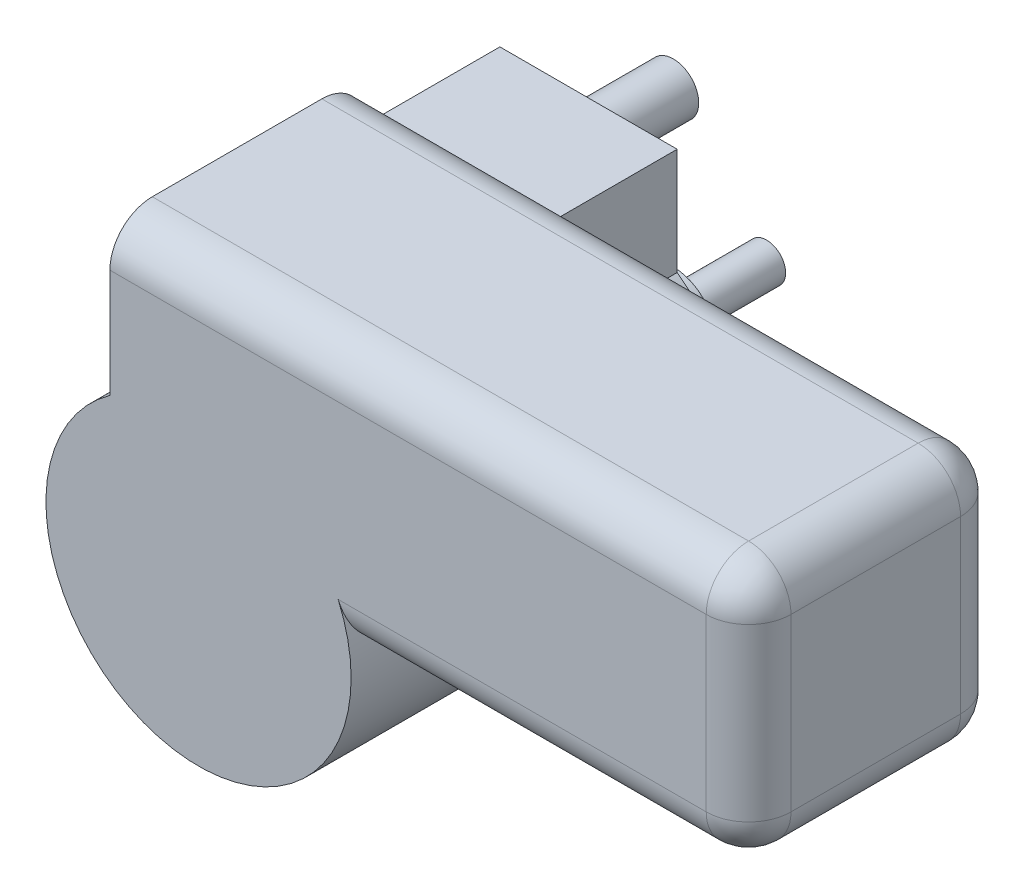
ISO-10303-21;
HEADER;
FILE_DESCRIPTION(('STEP AP214'),'2;1');
FILE_NAME('part.step','',(''),(''),'','','');
FILE_SCHEMA(('AUTOMOTIVE_DESIGN { 1 0 10303 214 1 1 1 1 }'));
ENDSEC;
DATA;
#1=APPLICATION_CONTEXT('core data for automotive mechanical design processes');
#2=APPLICATION_PROTOCOL_DEFINITION('international standard','automotive_design',2000,#1);
#3=PRODUCT_CONTEXT('',#1,'mechanical');
#4=PRODUCT('Part','Part','',(#3));
#5=PRODUCT_RELATED_PRODUCT_CATEGORY('part','',(#4));
#6=PRODUCT_DEFINITION_FORMATION('','',#4);
#7=PRODUCT_DEFINITION_CONTEXT('part definition',#1,'design');
#8=PRODUCT_DEFINITION('design','',#6,#7);
#9=PRODUCT_DEFINITION_SHAPE('','',#8);
#10=(LENGTH_UNIT() NAMED_UNIT(*) SI_UNIT(.MILLI.,.METRE.));
#11=(NAMED_UNIT(*) PLANE_ANGLE_UNIT() SI_UNIT($,.RADIAN.));
#12=(NAMED_UNIT(*) SI_UNIT($,.STERADIAN.) SOLID_ANGLE_UNIT());
#13=UNCERTAINTY_MEASURE_WITH_UNIT(LENGTH_MEASURE(1.E-05),#10,'distance_accuracy_value','');
#14=(GEOMETRIC_REPRESENTATION_CONTEXT(3) GLOBAL_UNCERTAINTY_ASSIGNED_CONTEXT((#13)) GLOBAL_UNIT_ASSIGNED_CONTEXT((#10,
#11,#12)) REPRESENTATION_CONTEXT('',''));
#15=CARTESIAN_POINT('',(0.,0.,0.));
#16=DIRECTION('',(0.,0.,1.));
#17=DIRECTION('',(1.,0.,0.));
#18=AXIS2_PLACEMENT_3D('',#15,#16,#17);
#19=CARTESIAN_POINT('',(0.,0.,92.));
#20=DIRECTION('',(0.,0.,-1.));
#21=DIRECTION('',(-1.,0.,0.));
#22=AXIS2_PLACEMENT_3D('',#19,#20,#21);
#23=CYLINDRICAL_SURFACE('',#22,36.);
#24=CARTESIAN_POINT('',(0.,0.,92.));
#25=DIRECTION('',(0.,0.,1.));
#26=DIRECTION('',(1.,0.,0.));
#27=AXIS2_PLACEMENT_3D('',#24,#25,#26);
#28=CIRCLE('',#27,36.);
#29=CARTESIAN_POINT('',(-20.9106427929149,29.3043515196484,92.));
#30=VERTEX_POINT('',#29);
#31=CARTESIAN_POINT('',(32.9329860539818,14.540234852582,92.));
#32=VERTEX_POINT('',#31);
#33=EDGE_CURVE('E231',#30,#32,#28,.T.);
#34=ORIENTED_EDGE('',*,*,#33,.F.);
#35=DIRECTION('',(0.,0.,-1.));
#36=VECTOR('',#35,1.);
#37=CARTESIAN_POINT('',(-20.9106427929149,29.3043515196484,92.));
#38=LINE('',#37,#36);
#39=CARTESIAN_POINT('',(-20.9106427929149,29.3043515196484,0.));
#40=VERTEX_POINT('',#39);
#41=EDGE_CURVE('E267',#30,#40,#38,.T.);
#42=ORIENTED_EDGE('',*,*,#41,.T.);
#43=CARTESIAN_POINT('',(0.,0.,0.));
#44=DIRECTION('',(0.,0.,1.));
#45=DIRECTION('',(1.,0.,0.));
#46=AXIS2_PLACEMENT_3D('',#43,#44,#45);
#47=CIRCLE('',#46,36.);
#48=CARTESIAN_POINT('',(-33.3723437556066,-13.5013581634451,0.));
#49=VERTEX_POINT('',#48);
#50=EDGE_CURVE('E272',#40,#49,#47,.T.);
#51=ORIENTED_EDGE('',*,*,#50,.T.);
#52=CARTESIAN_POINT('',(-28.220834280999,-22.3513872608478,0.));
#53=VERTEX_POINT('',#52);
#54=EDGE_CURVE('E275',#49,#53,#47,.T.);
#55=ORIENTED_EDGE('',*,*,#54,.T.);
#56=CARTESIAN_POINT('',(28.220834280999,-22.3513872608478,0.));
#57=VERTEX_POINT('',#56);
#58=EDGE_CURVE('E462',#53,#57,#47,.T.);
#59=ORIENTED_EDGE('',*,*,#58,.T.);
#60=CARTESIAN_POINT('',(33.3723437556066,-13.501358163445,0.));
#61=VERTEX_POINT('',#60);
#62=EDGE_CURVE('E459',#57,#61,#47,.T.);
#63=ORIENTED_EDGE('',*,*,#62,.T.);
#64=CARTESIAN_POINT('',(20.911,29.3040966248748,0.));
#65=VERTEX_POINT('',#64);
#66=EDGE_CURVE('E270',#61,#65,#47,.T.);
#67=ORIENTED_EDGE('',*,*,#66,.T.);
#68=DIRECTION('',(0.,0.,-1.));
#69=VECTOR('',#68,1.);
#70=CARTESIAN_POINT('',(20.911,29.3040966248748,80.8250279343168));
#71=LINE('',#70,#69);
#72=CARTESIAN_POINT('',(20.911,29.3040966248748,32.));
#73=VERTEX_POINT('',#72);
#74=EDGE_CURVE('E257',#73,#65,#71,.T.);
#75=ORIENTED_EDGE('',*,*,#74,.F.);
#76=CARTESIAN_POINT('',(0.,0.,32.));
#77=DIRECTION('',(0.,0.,1.));
#78=DIRECTION('',(1.,0.,0.));
#79=AXIS2_PLACEMENT_3D('',#76,#77,#78);
#80=CIRCLE('',#79,36.);
#81=CARTESIAN_POINT('',(32.9329860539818,14.540234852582,32.));
#82=VERTEX_POINT('',#81);
#83=EDGE_CURVE('E235',#82,#73,#80,.T.);
#84=ORIENTED_EDGE('',*,*,#83,.F.);
#85=CARTESIAN_POINT('',(32.9329860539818,14.540234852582,32.));
#86=CARTESIAN_POINT('',(33.0525376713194,14.2695371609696,31.9999731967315));
#87=CARTESIAN_POINT('',(33.1687141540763,13.9972899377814,32.0109919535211));
#88=CARTESIAN_POINT('',(33.3937626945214,13.4515110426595,32.05567773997));
#89=CARTESIAN_POINT('',(33.5026316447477,13.1779788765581,32.0893543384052));
#90=CARTESIAN_POINT('',(33.7125807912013,12.6312291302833,32.1799881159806));
#91=CARTESIAN_POINT('',(33.8136479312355,12.3580128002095,32.2369833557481));
#92=CARTESIAN_POINT('',(34.0073380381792,11.8145721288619,32.3745492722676));
#93=CARTESIAN_POINT('',(34.0999622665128,11.54434734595,32.4551164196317));
#94=CARTESIAN_POINT('',(34.2767541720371,11.0083609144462,32.6401664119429));
#95=CARTESIAN_POINT('',(34.3608956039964,10.7426151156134,32.7447203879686));
#96=CARTESIAN_POINT('',(34.5202857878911,10.2188459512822,32.9773776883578));
#97=CARTESIAN_POINT('',(34.5955340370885,9.96082302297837,33.1054823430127));
#98=CARTESIAN_POINT('',(34.7370971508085,9.45531080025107,33.3845030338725));
#99=CARTESIAN_POINT('',(34.8034234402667,9.20780831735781,33.5353893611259));
#100=CARTESIAN_POINT('',(34.9274847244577,8.72541354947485,33.8592239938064));
#101=CARTESIAN_POINT('',(34.9852202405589,8.49052049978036,34.0321709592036));
#102=CARTESIAN_POINT('',(35.0896312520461,8.04777869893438,34.3891834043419));
#103=CARTESIAN_POINT('',(35.136732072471,7.83915585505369,34.5721658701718));
#104=CARTESIAN_POINT('',(35.224019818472,7.43711965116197,34.9556462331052));
#105=CARTESIAN_POINT('',(35.2642069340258,7.24370587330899,35.156143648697));
#106=CARTESIAN_POINT('',(35.338193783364,6.87369519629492,35.5733410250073));
#107=CARTESIAN_POINT('',(35.3719908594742,6.69710530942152,35.7900476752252));
#108=CARTESIAN_POINT('',(35.4337343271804,6.36234647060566,36.2380274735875));
#109=CARTESIAN_POINT('',(35.4616808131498,6.20417722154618,36.4693003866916));
#110=CARTESIAN_POINT('',(35.511828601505,5.91031693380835,36.9403407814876));
#111=CARTESIAN_POINT('',(35.5341262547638,5.77426548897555,37.1798732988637));
#112=CARTESIAN_POINT('',(35.5741614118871,5.52225721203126,37.6696497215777));
#113=CARTESIAN_POINT('',(35.5918988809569,5.40630053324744,37.9198937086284));
#114=CARTESIAN_POINT('',(35.6232912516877,5.19543019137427,38.4292105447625));
#115=CARTESIAN_POINT('',(35.6369481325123,5.10050633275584,38.6882790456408));
#116=CARTESIAN_POINT('',(35.6606070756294,4.93237069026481,39.213425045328));
#117=CARTESIAN_POINT('',(35.6706099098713,4.85915432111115,39.4795010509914));
#118=CARTESIAN_POINT('',(35.690426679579,4.71179666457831,40.1171888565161));
#119=CARTESIAN_POINT('',(35.698781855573,4.64747315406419,40.4911877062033));
#120=CARTESIAN_POINT('',(35.7070743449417,4.58314604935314,41.0554087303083));
#121=CARTESIAN_POINT('',(35.7091318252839,4.56706339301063,41.2439229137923));
#122=CARTESIAN_POINT('',(35.7118680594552,4.54560775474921,41.6216077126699));
#123=CARTESIAN_POINT('',(35.712546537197,4.54023691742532,41.8107784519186));
#124=CARTESIAN_POINT('',(35.7125505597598,4.54023485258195,42.));
#125=B_SPLINE_CURVE_WITH_KNOTS('',3,(#85,#86,#87,#88,#89,#90,#91,#92,#93,#94,#95,#96,#97,#98,
#99,#100,#101,#102,#103,#104,#105,#106,#107,#108,#109,#110,#111,#112,#113,#114,#115,#116,#117,
#118,#119,#120,#121,#122,#123,#124),.UNSPECIFIED.,.F.,.F.,(4,2,2,2,2,2,2,2,2,2,2,2,2,2,2,2,2,2,
2,4),(0.,0.887617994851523,1.7756110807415,2.6650593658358,3.55437454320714,4.44636180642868,
5.33839947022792,6.22928374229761,7.12011392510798,7.96349078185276,8.80684446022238,
9.65054812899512,10.4942381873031,11.3223862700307,12.1505406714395,12.9782927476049,
13.8058698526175,14.9417669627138,15.5091391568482,16.0766249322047),.UNSPECIFIED.);
#126=CARTESIAN_POINT('',(35.7125505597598,4.54023485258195,42.));
#127=VERTEX_POINT('',#126);
#128=EDGE_CURVE('E51',#82,#127,#125,.T.);
#129=ORIENTED_EDGE('',*,*,#128,.T.);
#130=DIRECTION('',(0.,0.,1.));
#131=VECTOR('',#130,1.);
#132=CARTESIAN_POINT('',(35.7125505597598,4.54023485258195,32.));
#133=LINE('',#132,#131);
#134=CARTESIAN_POINT('',(35.7125505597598,4.54023485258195,82.));
#135=VERTEX_POINT('',#134);
#136=EDGE_CURVE('E240',#127,#135,#133,.T.);
#137=ORIENTED_EDGE('',*,*,#136,.T.);
#138=CARTESIAN_POINT('',(35.7125505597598,4.54023485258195,82.));
#139=CARTESIAN_POINT('',(35.7125300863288,4.5402037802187,82.2783398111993));
#140=CARTESIAN_POINT('',(35.7110725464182,4.55185451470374,82.5566763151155));
#141=CARTESIAN_POINT('',(35.7051352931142,4.59829619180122,83.1113718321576));
#142=CARTESIAN_POINT('',(35.7006556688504,4.63308645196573,83.3877309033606));
#143=CARTESIAN_POINT('',(35.6885295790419,4.72555820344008,83.9363654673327));
#144=CARTESIAN_POINT('',(35.6808848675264,4.78322701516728,84.2086431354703));
#145=CARTESIAN_POINT('',(35.6621437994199,4.92101229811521,84.7473326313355));
#146=CARTESIAN_POINT('',(35.6510474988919,5.00112840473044,85.0137445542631));
#147=CARTESIAN_POINT('',(35.6250233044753,5.1832582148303,85.5389681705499));
#148=CARTESIAN_POINT('',(35.6100930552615,5.28528537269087,85.797775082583));
#149=CARTESIAN_POINT('',(35.5759506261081,5.51041678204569,86.3057596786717));
#150=CARTESIAN_POINT('',(35.5567384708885,5.63352091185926,86.5549374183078));
#151=CARTESIAN_POINT('',(35.5135252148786,5.89980556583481,87.0418206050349));
#152=CARTESIAN_POINT('',(35.4895251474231,6.04298175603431,87.2795285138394));
#153=CARTESIAN_POINT('',(35.4361880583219,6.34827347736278,87.7418198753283));
#154=CARTESIAN_POINT('',(35.4068510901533,6.51038881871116,87.9664034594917));
#155=CARTESIAN_POINT('',(35.3424258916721,6.85149006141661,88.3999178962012));
#156=CARTESIAN_POINT('',(35.3073627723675,7.03040091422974,88.6089115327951));
#157=CARTESIAN_POINT('',(35.2308744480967,7.40417874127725,89.0108500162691));
#158=CARTESIAN_POINT('',(35.1894492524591,7.59904569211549,89.2037948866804));
#159=CARTESIAN_POINT('',(35.0997736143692,8.00304227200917,89.5723083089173));
#160=CARTESIAN_POINT('',(35.0515244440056,8.21216923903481,89.7478800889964));
#161=CARTESIAN_POINT('',(34.9478032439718,8.64292266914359,90.0805796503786));
#162=CARTESIAN_POINT('',(34.8923312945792,8.86454899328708,90.2377076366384));
#163=CARTESIAN_POINT('',(34.7740798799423,9.3176168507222,90.5321156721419));
#164=CARTESIAN_POINT('',(34.7113263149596,9.54902184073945,90.6694623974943));
#165=CARTESIAN_POINT('',(34.5781900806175,10.0204165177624,90.9242945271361));
#166=CARTESIAN_POINT('',(34.5078072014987,10.2604064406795,91.0417793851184));
#167=CARTESIAN_POINT('',(34.3593369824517,10.7471267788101,91.2565182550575));
#168=CARTESIAN_POINT('',(34.2812452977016,10.9938609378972,91.353760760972));
#169=CARTESIAN_POINT('',(34.1174922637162,11.4919723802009,91.5277320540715));
#170=CARTESIAN_POINT('',(34.0318317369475,11.7433491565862,91.6044630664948));
#171=CARTESIAN_POINT('',(33.8679112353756,12.2071591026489,91.7264796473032));
#172=CARTESIAN_POINT('',(33.7907606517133,12.4191776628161,91.774864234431));
#173=CARTESIAN_POINT('',(33.6315373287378,12.8441106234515,91.8574847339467));
#174=CARTESIAN_POINT('',(33.5494648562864,13.0570249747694,91.8917214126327));
#175=CARTESIAN_POINT('',(33.3808299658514,13.4822974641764,91.9461860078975));
#176=CARTESIAN_POINT('',(33.2942779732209,13.6946557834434,91.9664450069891));
#177=CARTESIAN_POINT('',(33.1168226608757,14.1183935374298,91.9933557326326));
#178=CARTESIAN_POINT('',(33.0259197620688,14.3297730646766,92.0000087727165));
#179=CARTESIAN_POINT('',(32.9329860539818,14.5402348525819,92.));
#180=B_SPLINE_CURVE_WITH_KNOTS('',3,(#138,#139,#140,#141,#142,#143,#144,#145,#146,#147,#148,
#149,#150,#151,#152,#153,#154,#155,#156,#157,#158,#159,#160,#161,#162,#163,#164,#165,#166,#167,
#168,#169,#170,#171,#172,#173,#174,#175,#176,#177,#178,#179),.UNSPECIFIED.,.F.,.F.,(4,2,2,2,2,2,
2,2,2,2,2,2,2,2,2,2,2,2,2,2,4),(0.,0.834767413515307,1.66951020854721,2.50379102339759,
3.33805828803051,4.17283930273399,5.00761549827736,5.8422117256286,6.67679959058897,
7.50782123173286,8.33884165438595,9.16970736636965,10.0005638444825,10.8285507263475,
11.6565603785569,12.4850394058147,13.3134285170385,14.0051979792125,14.6969299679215,
15.3871187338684,16.0772408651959),.UNSPECIFIED.);
#181=EDGE_CURVE('E11',#135,#32,#180,.T.);
#182=ORIENTED_EDGE('',*,*,#181,.T.);
#183=EDGE_LOOP('',(#34,#42,#51,#55,#59,#63,#67,#75,#84,#129,#137,#182));
#184=FACE_BOUND('',#183,.T.);
#185=ADVANCED_FACE('F42',(#184),#23,.T.);
#186=CARTESIAN_POINT('',(0.,0.,92.));
#187=DIRECTION('',(0.,0.,1.));
#188=DIRECTION('',(1.,0.,0.));
#189=AXIS2_PLACEMENT_3D('',#186,#187,#188);
#190=PLANE('',#189);
#191=DIRECTION('',(-1.,0.,0.));
#192=VECTOR('',#191,1.);
#193=CARTESIAN_POINT('',(129.762841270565,14.540234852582,92.));
#194=LINE('',#193,#192);
#195=CARTESIAN_POINT('',(119.762841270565,14.540234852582,92.));
#196=VERTEX_POINT('',#195);
#197=EDGE_CURVE('E302',#32,#196,#194,.F.);
#198=ORIENTED_EDGE('',*,*,#197,.T.);
#199=DIRECTION('',(0.,-1.,0.));
#200=VECTOR('',#199,1.);
#201=CARTESIAN_POINT('',(119.762841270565,54.8814206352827,92.));
#202=LINE('',#201,#200);
#203=CARTESIAN_POINT('',(119.762841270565,54.8814206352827,92.));
#204=VERTEX_POINT('',#203);
#205=EDGE_CURVE('E304',#196,#204,#202,.F.);
#206=ORIENTED_EDGE('',*,*,#205,.T.);
#207=DIRECTION('',(1.,0.,0.));
#208=VECTOR('',#207,1.);
#209=CARTESIAN_POINT('',(-20.9106427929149,54.8814206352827,92.));
#210=LINE('',#209,#208);
#211=CARTESIAN_POINT('',(-20.9106427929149,54.8814206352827,92.));
#212=VERTEX_POINT('',#211);
#213=EDGE_CURVE('E291',#204,#212,#210,.F.);
#214=ORIENTED_EDGE('',*,*,#213,.T.);
#215=DIRECTION('',(0.,1.,0.));
#216=VECTOR('',#215,1.);
#217=CARTESIAN_POINT('',(-20.9106427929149,0.,92.));
#218=LINE('',#217,#216);
#219=EDGE_CURVE('E226',#30,#212,#218,.T.);
#220=ORIENTED_EDGE('',*,*,#219,.F.);
#221=ORIENTED_EDGE('',*,*,#33,.T.);
#222=EDGE_LOOP('',(#198,#206,#214,#220,#221));
#223=FACE_BOUND('',#222,.T.);
#224=ADVANCED_FACE('F386',(#223),#190,.T.);
#225=CARTESIAN_POINT('',(0.,0.,0.));
#226=DIRECTION('',(0.,0.,1.));
#227=DIRECTION('',(1.,0.,0.));
#228=AXIS2_PLACEMENT_3D('',#225,#226,#227);
#229=PLANE('',#228);
#230=CARTESIAN_POINT('',(0.,46.5,0.));
#231=DIRECTION('',(0.,0.,1.));
#232=DIRECTION('',(1.,0.,0.));
#233=AXIS2_PLACEMENT_3D('',#230,#231,#232);
#234=CIRCLE('',#233,6.);
#235=CARTESIAN_POINT('',(6.,46.5,0.));
#236=VERTEX_POINT('',#235);
#237=EDGE_CURVE('E207',#236,#236,#234,.F.);
#238=ORIENTED_EDGE('',*,*,#237,.F.);
#239=EDGE_LOOP('',(#238));
#240=FACE_BOUND('',#239,.T.);
#241=CARTESIAN_POINT('',(33.5,-19.5,0.));
#242=DIRECTION('',(0.,0.,1.));
#243=DIRECTION('',(1.,0.,0.));
#244=AXIS2_PLACEMENT_3D('',#241,#242,#243);
#245=CIRCLE('',#244,6.);
#246=EDGE_CURVE('E230',#57,#61,#245,.F.);
#247=ORIENTED_EDGE('',*,*,#246,.F.);
#248=ORIENTED_EDGE('',*,*,#58,.F.);
#249=CARTESIAN_POINT('',(-33.5,-19.5,0.));
#250=DIRECTION('',(0.,0.,-1.));
#251=DIRECTION('',(-1.,0.,0.));
#252=AXIS2_PLACEMENT_3D('',#249,#250,#251);
#253=CIRCLE('',#252,6.);
#254=EDGE_CURVE('E221',#49,#53,#253,.T.);
#255=ORIENTED_EDGE('',*,*,#254,.F.);
#256=ORIENTED_EDGE('',*,*,#50,.F.);
#257=DIRECTION('',(0.,1.,0.));
#258=VECTOR('',#257,1.);
#259=CARTESIAN_POINT('',(-20.9106427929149,29.3040966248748,0.));
#260=LINE('',#259,#258);
#261=CARTESIAN_POINT('',(-20.9106427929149,54.5,0.));
#262=VERTEX_POINT('',#261);
#263=EDGE_CURVE('E250',#40,#262,#260,.T.);
#264=ORIENTED_EDGE('',*,*,#263,.T.);
#265=DIRECTION('',(1.,0.,0.));
#266=VECTOR('',#265,1.);
#267=CARTESIAN_POINT('',(20.911,54.5,0.));
#268=LINE('',#267,#266);
#269=CARTESIAN_POINT('',(20.911,54.5,0.));
#270=VERTEX_POINT('',#269);
#271=EDGE_CURVE('E246',#262,#270,#268,.T.);
#272=ORIENTED_EDGE('',*,*,#271,.T.);
#273=DIRECTION('',(0.,-1.,0.));
#274=VECTOR('',#273,1.);
#275=CARTESIAN_POINT('',(20.911,29.3040966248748,0.));
#276=LINE('',#275,#274);
#277=EDGE_CURVE('E243',#270,#65,#276,.T.);
#278=ORIENTED_EDGE('',*,*,#277,.T.);
#279=ORIENTED_EDGE('',*,*,#66,.F.);
#280=EDGE_LOOP('',(#247,#248,#255,#256,#264,#272,#278,#279));
#281=FACE_BOUND('',#280,.T.);
#282=CARTESIAN_POINT('',(0.,0.,0.));
#283=DIRECTION('',(0.,0.,-1.));
#284=DIRECTION('',(-1.,0.,0.));
#285=AXIS2_PLACEMENT_3D('',#282,#283,#284);
#286=CIRCLE('',#285,10.);
#287=CARTESIAN_POINT('',(-10.,0.,0.));
#288=VERTEX_POINT('',#287);
#289=EDGE_CURVE('E227',#288,#288,#286,.T.);
#290=ORIENTED_EDGE('',*,*,#289,.F.);
#291=EDGE_LOOP('',(#290));
#292=FACE_BOUND('',#291,.T.);
#293=ADVANCED_FACE('F391',(#240,#281,#292),#229,.F.);
#294=CARTESIAN_POINT('',(-20.9106427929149,29.3040966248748,80.8250279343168));
#295=DIRECTION('',(-1.,0.,0.));
#296=DIRECTION('',(0.,-1.,0.));
#297=AXIS2_PLACEMENT_3D('',#294,#295,#296);
#298=PLANE('',#297);
#299=DIRECTION('',(0.,0.,1.));
#300=VECTOR('',#299,1.);
#301=CARTESIAN_POINT('',(-20.9106427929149,64.8814206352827,32.));
#302=LINE('',#301,#300);
#303=CARTESIAN_POINT('',(-20.9106427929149,64.8814206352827,42.));
#304=VERTEX_POINT('',#303);
#305=CARTESIAN_POINT('',(-20.9106427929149,64.8814206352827,82.));
#306=VERTEX_POINT('',#305);
#307=EDGE_CURVE('E237',#304,#306,#302,.T.);
#308=ORIENTED_EDGE('',*,*,#307,.F.);
#309=CARTESIAN_POINT('',(-20.9106427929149,54.8814206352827,42.));
#310=DIRECTION('',(-1.,0.,0.));
#311=DIRECTION('',(0.,-1.,0.));
#312=AXIS2_PLACEMENT_3D('',#309,#310,#311);
#313=CIRCLE('',#312,10.);
#314=CARTESIAN_POINT('',(-20.9106427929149,54.8814206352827,32.));
#315=VERTEX_POINT('',#314);
#316=EDGE_CURVE('E289',#304,#315,#313,.T.);
#317=ORIENTED_EDGE('',*,*,#316,.T.);
#318=DIRECTION('',(0.,1.,0.));
#319=VECTOR('',#318,1.);
#320=CARTESIAN_POINT('',(-20.9106427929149,0.,32.));
#321=LINE('',#320,#319);
#322=CARTESIAN_POINT('',(-20.9106427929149,54.5,32.));
#323=VERTEX_POINT('',#322);
#324=EDGE_CURVE('E232',#323,#315,#321,.T.);
#325=ORIENTED_EDGE('',*,*,#324,.F.);
#326=DIRECTION('',(0.,0.,-1.));
#327=VECTOR('',#326,1.);
#328=CARTESIAN_POINT('',(-20.9106427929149,54.5,80.8250279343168));
#329=LINE('',#328,#327);
#330=EDGE_CURVE('E249',#323,#262,#329,.T.);
#331=ORIENTED_EDGE('',*,*,#330,.T.);
#332=ORIENTED_EDGE('',*,*,#263,.F.);
#333=ORIENTED_EDGE('',*,*,#41,.F.);
#334=ORIENTED_EDGE('',*,*,#219,.T.);
#335=CARTESIAN_POINT('',(-20.9106427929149,54.8814206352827,82.));
#336=DIRECTION('',(-1.,0.,0.));
#337=DIRECTION('',(0.,-1.,0.));
#338=AXIS2_PLACEMENT_3D('',#335,#336,#337);
#339=CIRCLE('',#338,10.);
#340=EDGE_CURVE('E287',#212,#306,#339,.T.);
#341=ORIENTED_EDGE('',*,*,#340,.T.);
#342=EDGE_LOOP('',(#308,#317,#325,#331,#332,#333,#334,#341));
#343=FACE_BOUND('',#342,.T.);
#344=ADVANCED_FACE('F404',(#343),#298,.T.);
#345=CARTESIAN_POINT('',(20.911,54.5,80.8250279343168));
#346=DIRECTION('',(0.,1.,0.));
#347=DIRECTION('',(0.,0.,1.));
#348=AXIS2_PLACEMENT_3D('',#345,#346,#347);
#349=PLANE('',#348);
#350=ORIENTED_EDGE('',*,*,#330,.F.);
#351=DIRECTION('',(1.,0.,0.));
#352=VECTOR('',#351,1.);
#353=CARTESIAN_POINT('',(20.911,54.5,32.));
#354=LINE('',#353,#352);
#355=CARTESIAN_POINT('',(20.911,54.5,32.));
#356=VERTEX_POINT('',#355);
#357=EDGE_CURVE('E259',#323,#356,#354,.T.);
#358=ORIENTED_EDGE('',*,*,#357,.T.);
#359=DIRECTION('',(0.,0.,-1.));
#360=VECTOR('',#359,1.);
#361=CARTESIAN_POINT('',(20.911,54.5,80.8250279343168));
#362=LINE('',#361,#360);
#363=EDGE_CURVE('E258',#356,#270,#362,.T.);
#364=ORIENTED_EDGE('',*,*,#363,.T.);
#365=ORIENTED_EDGE('',*,*,#271,.F.);
#366=EDGE_LOOP('',(#350,#358,#364,#365));
#367=FACE_BOUND('',#366,.T.);
#368=ADVANCED_FACE('F474',(#367),#349,.T.);
#369=CARTESIAN_POINT('',(20.911,29.3040966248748,80.8250279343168));
#370=DIRECTION('',(1.,0.,0.));
#371=DIRECTION('',(0.,1.,0.));
#372=AXIS2_PLACEMENT_3D('',#369,#370,#371);
#373=PLANE('',#372);
#374=ORIENTED_EDGE('',*,*,#363,.F.);
#375=DIRECTION('',(0.,-1.,0.));
#376=VECTOR('',#375,1.);
#377=CARTESIAN_POINT('',(20.911,29.3040966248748,32.));
#378=LINE('',#377,#376);
#379=EDGE_CURVE('E254',#356,#73,#378,.T.);
#380=ORIENTED_EDGE('',*,*,#379,.T.);
#381=ORIENTED_EDGE('',*,*,#74,.T.);
#382=ORIENTED_EDGE('',*,*,#277,.F.);
#383=EDGE_LOOP('',(#374,#380,#381,#382));
#384=FACE_BOUND('',#383,.T.);
#385=ADVANCED_FACE('F469',(#384),#373,.T.);
#386=CARTESIAN_POINT('',(0.,4.54023485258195,32.));
#387=DIRECTION('',(0.,1.,0.));
#388=DIRECTION('',(0.,0.,1.));
#389=AXIS2_PLACEMENT_3D('',#386,#387,#388);
#390=PLANE('',#389);
#391=ORIENTED_EDGE('',*,*,#136,.F.);
#392=DIRECTION('',(-1.,0.,0.));
#393=VECTOR('',#392,1.);
#394=CARTESIAN_POINT('',(0.,4.54023485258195,42.));
#395=LINE('',#394,#393);
#396=CARTESIAN_POINT('',(119.762841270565,4.54023485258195,42.));
#397=VERTEX_POINT('',#396);
#398=EDGE_CURVE('E59',#127,#397,#395,.F.);
#399=ORIENTED_EDGE('',*,*,#398,.T.);
#400=DIRECTION('',(0.,0.,1.));
#401=VECTOR('',#400,1.);
#402=CARTESIAN_POINT('',(119.762841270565,4.54023485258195,32.));
#403=LINE('',#402,#401);
#404=CARTESIAN_POINT('',(119.762841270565,4.54023485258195,82.));
#405=VERTEX_POINT('',#404);
#406=EDGE_CURVE('E64',#397,#405,#403,.T.);
#407=ORIENTED_EDGE('',*,*,#406,.T.);
#408=DIRECTION('',(-1.,0.,0.));
#409=VECTOR('',#408,1.);
#410=CARTESIAN_POINT('',(35.7125505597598,4.54023485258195,82.));
#411=LINE('',#410,#409);
#412=EDGE_CURVE('E317',#405,#135,#411,.T.);
#413=ORIENTED_EDGE('',*,*,#412,.T.);
#414=EDGE_LOOP('',(#391,#399,#407,#413));
#415=FACE_BOUND('',#414,.T.);
#416=ADVANCED_FACE('F485',(#415),#390,.F.);
#417=CARTESIAN_POINT('',(0.,64.8814206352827,32.));
#418=DIRECTION('',(0.,-1.,0.));
#419=DIRECTION('',(0.,0.,-1.));
#420=AXIS2_PLACEMENT_3D('',#417,#418,#419);
#421=PLANE('',#420);
#422=DIRECTION('',(1.,0.,0.));
#423=VECTOR('',#422,1.);
#424=CARTESIAN_POINT('',(129.762841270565,64.8814206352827,82.));
#425=LINE('',#424,#423);
#426=CARTESIAN_POINT('',(119.762841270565,64.8814206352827,82.));
#427=VERTEX_POINT('',#426);
#428=EDGE_CURVE('E282',#306,#427,#425,.T.);
#429=ORIENTED_EDGE('',*,*,#428,.T.);
#430=DIRECTION('',(0.,0.,1.));
#431=VECTOR('',#430,1.);
#432=CARTESIAN_POINT('',(119.762841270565,64.8814206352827,32.));
#433=LINE('',#432,#431);
#434=CARTESIAN_POINT('',(119.762841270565,64.8814206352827,42.));
#435=VERTEX_POINT('',#434);
#436=EDGE_CURVE('E309',#427,#435,#433,.F.);
#437=ORIENTED_EDGE('',*,*,#436,.T.);
#438=DIRECTION('',(1.,0.,0.));
#439=VECTOR('',#438,1.);
#440=CARTESIAN_POINT('',(0.,64.8814206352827,42.));
#441=LINE('',#440,#439);
#442=EDGE_CURVE('E285',#435,#304,#441,.F.);
#443=ORIENTED_EDGE('',*,*,#442,.T.);
#444=ORIENTED_EDGE('',*,*,#307,.T.);
#445=EDGE_LOOP('',(#429,#437,#443,#444));
#446=FACE_BOUND('',#445,.T.);
#447=ADVANCED_FACE('F409',(#446),#421,.F.);
#448=CARTESIAN_POINT('',(129.762841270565,0.,32.));
#449=DIRECTION('',(-1.,0.,0.));
#450=DIRECTION('',(0.,0.,1.));
#451=AXIS2_PLACEMENT_3D('',#448,#449,#450);
#452=PLANE('',#451);
#453=DIRECTION('',(0.,0.,1.));
#454=VECTOR('',#453,1.);
#455=CARTESIAN_POINT('',(129.762841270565,54.8814206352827,32.));
#456=LINE('',#455,#454);
#457=CARTESIAN_POINT('',(129.762841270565,54.8814206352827,42.));
#458=VERTEX_POINT('',#457);
#459=CARTESIAN_POINT('',(129.762841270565,54.8814206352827,82.));
#460=VERTEX_POINT('',#459);
#461=EDGE_CURVE('E297',#458,#460,#456,.T.);
#462=ORIENTED_EDGE('',*,*,#461,.T.);
#463=DIRECTION('',(0.,-1.,0.));
#464=VECTOR('',#463,1.);
#465=CARTESIAN_POINT('',(129.762841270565,4.54023485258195,82.));
#466=LINE('',#465,#464);
#467=CARTESIAN_POINT('',(129.762841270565,14.540234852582,82.));
#468=VERTEX_POINT('',#467);
#469=EDGE_CURVE('E299',#460,#468,#466,.T.);
#470=ORIENTED_EDGE('',*,*,#469,.T.);
#471=DIRECTION('',(0.,0.,1.));
#472=VECTOR('',#471,1.);
#473=CARTESIAN_POINT('',(129.762841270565,14.540234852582,32.));
#474=LINE('',#473,#472);
#475=CARTESIAN_POINT('',(129.762841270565,14.540234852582,42.));
#476=VERTEX_POINT('',#475);
#477=EDGE_CURVE('E293',#468,#476,#474,.F.);
#478=ORIENTED_EDGE('',*,*,#477,.T.);
#479=DIRECTION('',(0.,-1.,0.));
#480=VECTOR('',#479,1.);
#481=CARTESIAN_POINT('',(129.762841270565,0.,42.));
#482=LINE('',#481,#480);
#483=EDGE_CURVE('E295',#476,#458,#482,.F.);
#484=ORIENTED_EDGE('',*,*,#483,.T.);
#485=EDGE_LOOP('',(#462,#470,#478,#484));
#486=FACE_BOUND('',#485,.T.);
#487=ADVANCED_FACE('F494',(#486),#452,.F.);
#488=CARTESIAN_POINT('',(0.,0.,32.));
#489=DIRECTION('',(0.,0.,1.));
#490=DIRECTION('',(1.,0.,0.));
#491=AXIS2_PLACEMENT_3D('',#488,#489,#490);
#492=PLANE('',#491);
#493=DIRECTION('',(1.,0.,0.));
#494=VECTOR('',#493,1.);
#495=CARTESIAN_POINT('',(0.,54.8814206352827,32.));
#496=LINE('',#495,#494);
#497=CARTESIAN_POINT('',(119.762841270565,54.8814206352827,32.));
#498=VERTEX_POINT('',#497);
#499=EDGE_CURVE('E206',#315,#498,#496,.T.);
#500=ORIENTED_EDGE('',*,*,#499,.T.);
#501=DIRECTION('',(0.,-1.,0.));
#502=VECTOR('',#501,1.);
#503=CARTESIAN_POINT('',(119.762841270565,0.,32.));
#504=LINE('',#503,#502);
#505=CARTESIAN_POINT('',(119.762841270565,14.540234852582,32.));
#506=VERTEX_POINT('',#505);
#507=EDGE_CURVE('E315',#498,#506,#504,.T.);
#508=ORIENTED_EDGE('',*,*,#507,.T.);
#509=DIRECTION('',(-1.,0.,0.));
#510=VECTOR('',#509,1.);
#511=CARTESIAN_POINT('',(0.,14.540234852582,32.));
#512=LINE('',#511,#510);
#513=EDGE_CURVE('E313',#506,#82,#512,.T.);
#514=ORIENTED_EDGE('',*,*,#513,.T.);
#515=ORIENTED_EDGE('',*,*,#83,.T.);
#516=ORIENTED_EDGE('',*,*,#379,.F.);
#517=ORIENTED_EDGE('',*,*,#357,.F.);
#518=ORIENTED_EDGE('',*,*,#324,.T.);
#519=EDGE_LOOP('',(#500,#508,#514,#515,#516,#517,#518));
#520=FACE_BOUND('',#519,.T.);
#521=ADVANCED_FACE('F477',(#520),#492,.F.);
#522=CARTESIAN_POINT('',(0.,0.,-20.));
#523=DIRECTION('',(0.,0.,1.));
#524=DIRECTION('',(1.,0.,0.));
#525=AXIS2_PLACEMENT_3D('',#522,#523,#524);
#526=CYLINDRICAL_SURFACE('',#525,10.);
#527=CARTESIAN_POINT('',(0.,0.,-20.));
#528=DIRECTION('',(0.,0.,-1.));
#529=DIRECTION('',(-1.,0.,0.));
#530=AXIS2_PLACEMENT_3D('',#527,#528,#529);
#531=CIRCLE('',#530,10.);
#532=CARTESIAN_POINT('',(-10.,0.,-20.));
#533=VERTEX_POINT('',#532);
#534=EDGE_CURVE('E220',#533,#533,#531,.T.);
#535=ORIENTED_EDGE('',*,*,#534,.F.);
#536=EDGE_LOOP('',(#535));
#537=FACE_BOUND('',#536,.T.);
#538=ORIENTED_EDGE('',*,*,#289,.T.);
#539=EDGE_LOOP('',(#538));
#540=FACE_BOUND('',#539,.T.);
#541=ADVANCED_FACE('F501',(#537,#540),#526,.T.);
#542=CARTESIAN_POINT('',(0.,0.,-20.));
#543=DIRECTION('',(0.,0.,-1.));
#544=DIRECTION('',(-1.,0.,0.));
#545=AXIS2_PLACEMENT_3D('',#542,#543,#544);
#546=PLANE('',#545);
#547=CARTESIAN_POINT('',(0.,0.,-20.));
#548=DIRECTION('',(0.,0.,-1.));
#549=DIRECTION('',(-1.,0.,0.));
#550=AXIS2_PLACEMENT_3D('',#547,#548,#549);
#551=CIRCLE('',#550,4.5);
#552=CARTESIAN_POINT('',(-4.5,0.,-20.));
#553=VERTEX_POINT('',#552);
#554=EDGE_CURVE('E203',#553,#553,#551,.T.);
#555=ORIENTED_EDGE('',*,*,#554,.F.);
#556=EDGE_LOOP('',(#555));
#557=FACE_BOUND('',#556,.T.);
#558=ORIENTED_EDGE('',*,*,#534,.T.);
#559=EDGE_LOOP('',(#558));
#560=FACE_BOUND('',#559,.T.);
#561=ADVANCED_FACE('F544',(#557,#560),#546,.T.);
#562=CARTESIAN_POINT('',(-33.5,-19.5,-20.));
#563=DIRECTION('',(0.,0.,1.));
#564=DIRECTION('',(1.,0.,0.));
#565=AXIS2_PLACEMENT_3D('',#562,#563,#564);
#566=CYLINDRICAL_SURFACE('',#565,6.);
#567=CARTESIAN_POINT('',(-33.5,-19.5,-20.));
#568=DIRECTION('',(0.,0.,-1.));
#569=DIRECTION('',(-1.,0.,0.));
#570=AXIS2_PLACEMENT_3D('',#567,#568,#569);
#571=CIRCLE('',#570,6.);
#572=CARTESIAN_POINT('',(-39.5,-19.5,-20.));
#573=VERTEX_POINT('',#572);
#574=EDGE_CURVE('E217',#573,#573,#571,.T.);
#575=ORIENTED_EDGE('',*,*,#574,.F.);
#576=EDGE_LOOP('',(#575));
#577=FACE_BOUND('',#576,.T.);
#578=ORIENTED_EDGE('',*,*,#254,.T.);
#579=EDGE_CURVE('E214',#53,#49,#253,.T.);
#580=ORIENTED_EDGE('',*,*,#579,.T.);
#581=EDGE_LOOP('',(#578,#580));
#582=FACE_BOUND('',#581,.T.);
#583=ADVANCED_FACE('F537',(#577,#582),#566,.T.);
#584=CARTESIAN_POINT('',(-33.5,-19.5,-20.));
#585=DIRECTION('',(0.,0.,-1.));
#586=DIRECTION('',(-1.,0.,0.));
#587=AXIS2_PLACEMENT_3D('',#584,#585,#586);
#588=PLANE('',#587);
#589=CARTESIAN_POINT('',(-33.5,-19.5,-20.));
#590=DIRECTION('',(0.,0.,-1.));
#591=DIRECTION('',(-1.,0.,0.));
#592=AXIS2_PLACEMENT_3D('',#589,#590,#591);
#593=CIRCLE('',#592,3.025);
#594=CARTESIAN_POINT('',(-36.525,-19.5,-20.));
#595=VERTEX_POINT('',#594);
#596=EDGE_CURVE('E174',#595,#595,#593,.T.);
#597=ORIENTED_EDGE('',*,*,#596,.F.);
#598=EDGE_LOOP('',(#597));
#599=FACE_BOUND('',#598,.T.);
#600=ORIENTED_EDGE('',*,*,#574,.T.);
#601=EDGE_LOOP('',(#600));
#602=FACE_BOUND('',#601,.T.);
#603=ADVANCED_FACE('F534',(#599,#602),#588,.T.);
#604=CARTESIAN_POINT('',(-33.5,-19.5,0.));
#605=DIRECTION('',(0.,0.,-1.));
#606=DIRECTION('',(-1.,0.,0.));
#607=AXIS2_PLACEMENT_3D('',#604,#605,#606);
#608=PLANE('',#607);
#609=ORIENTED_EDGE('',*,*,#579,.F.);
#610=ORIENTED_EDGE('',*,*,#54,.F.);
#611=EDGE_LOOP('',(#609,#610));
#612=FACE_BOUND('',#611,.T.);
#613=ADVANCED_FACE('F454',(#612),#608,.F.);
#614=CARTESIAN_POINT('',(33.5,-19.5,-20.));
#615=DIRECTION('',(0.,0.,1.));
#616=DIRECTION('',(1.,0.,0.));
#617=AXIS2_PLACEMENT_3D('',#614,#615,#616);
#618=CYLINDRICAL_SURFACE('',#617,6.);
#619=CARTESIAN_POINT('',(33.5,-19.5,-20.));
#620=DIRECTION('',(0.,0.,-1.));
#621=DIRECTION('',(-1.,0.,0.));
#622=AXIS2_PLACEMENT_3D('',#619,#620,#621);
#623=CIRCLE('',#622,6.);
#624=CARTESIAN_POINT('',(27.5,-19.5,-20.));
#625=VERTEX_POINT('',#624);
#626=EDGE_CURVE('E211',#625,#625,#623,.T.);
#627=ORIENTED_EDGE('',*,*,#626,.F.);
#628=EDGE_LOOP('',(#627));
#629=FACE_BOUND('',#628,.T.);
#630=CARTESIAN_POINT('',(33.5,-19.5,0.));
#631=DIRECTION('',(0.,0.,-1.));
#632=DIRECTION('',(-1.,0.,0.));
#633=AXIS2_PLACEMENT_3D('',#630,#631,#632);
#634=CIRCLE('',#633,6.);
#635=EDGE_CURVE('E210',#61,#57,#634,.T.);
#636=ORIENTED_EDGE('',*,*,#635,.T.);
#637=ORIENTED_EDGE('',*,*,#246,.T.);
#638=EDGE_LOOP('',(#636,#637));
#639=FACE_BOUND('',#638,.T.);
#640=ADVANCED_FACE('F448',(#629,#639),#618,.T.);
#641=CARTESIAN_POINT('',(33.5,-19.5,-20.));
#642=DIRECTION('',(0.,0.,-1.));
#643=DIRECTION('',(-1.,0.,0.));
#644=AXIS2_PLACEMENT_3D('',#641,#642,#643);
#645=PLANE('',#644);
#646=CARTESIAN_POINT('',(33.5,-19.5,-20.));
#647=DIRECTION('',(0.,0.,-1.));
#648=DIRECTION('',(-1.,0.,0.));
#649=AXIS2_PLACEMENT_3D('',#646,#647,#648);
#650=CIRCLE('',#649,3.025);
#651=CARTESIAN_POINT('',(30.475,-19.5,-20.));
#652=VERTEX_POINT('',#651);
#653=EDGE_CURVE('E181',#652,#652,#650,.T.);
#654=ORIENTED_EDGE('',*,*,#653,.F.);
#655=EDGE_LOOP('',(#654));
#656=FACE_BOUND('',#655,.T.);
#657=ORIENTED_EDGE('',*,*,#626,.T.);
#658=EDGE_LOOP('',(#657));
#659=FACE_BOUND('',#658,.T.);
#660=ADVANCED_FACE('F444',(#656,#659),#645,.T.);
#661=CARTESIAN_POINT('',(33.5,-19.5,0.));
#662=DIRECTION('',(0.,0.,-1.));
#663=DIRECTION('',(-1.,0.,0.));
#664=AXIS2_PLACEMENT_3D('',#661,#662,#663);
#665=PLANE('',#664);
#666=ORIENTED_EDGE('',*,*,#635,.F.);
#667=ORIENTED_EDGE('',*,*,#62,.F.);
#668=EDGE_LOOP('',(#666,#667));
#669=FACE_BOUND('',#668,.T.);
#670=ADVANCED_FACE('F447',(#669),#665,.F.);
#671=CARTESIAN_POINT('',(0.,46.5,-20.));
#672=DIRECTION('',(0.,0.,1.));
#673=DIRECTION('',(1.,0.,0.));
#674=AXIS2_PLACEMENT_3D('',#671,#672,#673);
#675=CYLINDRICAL_SURFACE('',#674,6.);
#676=CARTESIAN_POINT('',(0.,46.5,-20.));
#677=DIRECTION('',(0.,0.,-1.));
#678=DIRECTION('',(-1.,0.,0.));
#679=AXIS2_PLACEMENT_3D('',#676,#677,#678);
#680=CIRCLE('',#679,6.);
#681=CARTESIAN_POINT('',(-6.,46.5,-20.));
#682=VERTEX_POINT('',#681);
#683=EDGE_CURVE('E202',#682,#682,#680,.T.);
#684=ORIENTED_EDGE('',*,*,#683,.F.);
#685=EDGE_LOOP('',(#684));
#686=FACE_BOUND('',#685,.T.);
#687=ORIENTED_EDGE('',*,*,#237,.T.);
#688=EDGE_LOOP('',(#687));
#689=FACE_BOUND('',#688,.T.);
#690=ADVANCED_FACE('F518',(#686,#689),#675,.T.);
#691=CARTESIAN_POINT('',(0.,46.5,-20.));
#692=DIRECTION('',(0.,0.,-1.));
#693=DIRECTION('',(-1.,0.,0.));
#694=AXIS2_PLACEMENT_3D('',#691,#692,#693);
#695=PLANE('',#694);
#696=CARTESIAN_POINT('',(0.,46.5,-20.));
#697=DIRECTION('',(0.,0.,-1.));
#698=DIRECTION('',(-1.,0.,0.));
#699=AXIS2_PLACEMENT_3D('',#696,#697,#698);
#700=CIRCLE('',#699,3.025);
#701=CARTESIAN_POINT('',(-3.025,46.5,-20.));
#702=VERTEX_POINT('',#701);
#703=EDGE_CURVE('E190',#702,#702,#700,.T.);
#704=ORIENTED_EDGE('',*,*,#703,.F.);
#705=EDGE_LOOP('',(#704));
#706=FACE_BOUND('',#705,.T.);
#707=ORIENTED_EDGE('',*,*,#683,.T.);
#708=EDGE_LOOP('',(#707));
#709=FACE_BOUND('',#708,.T.);
#710=ADVANCED_FACE('F520',(#706,#709),#695,.T.);
#711=CARTESIAN_POINT('',(0.,0.,-42.));
#712=DIRECTION('',(0.,0.,1.));
#713=DIRECTION('',(1.,0.,0.));
#714=AXIS2_PLACEMENT_3D('',#711,#712,#713);
#715=CYLINDRICAL_SURFACE('',#714,4.5);
#716=CARTESIAN_POINT('',(0.,0.,-42.));
#717=DIRECTION('',(0.,0.,-1.));
#718=DIRECTION('',(-1.,0.,0.));
#719=AXIS2_PLACEMENT_3D('',#716,#717,#718);
#720=CIRCLE('',#719,4.5);
#721=CARTESIAN_POINT('',(-4.5,0.,-42.));
#722=VERTEX_POINT('',#721);
#723=EDGE_CURVE('E199',#722,#722,#720,.T.);
#724=ORIENTED_EDGE('',*,*,#723,.F.);
#725=EDGE_LOOP('',(#724));
#726=FACE_BOUND('',#725,.T.);
#727=ORIENTED_EDGE('',*,*,#554,.T.);
#728=EDGE_LOOP('',(#727));
#729=FACE_BOUND('',#728,.T.);
#730=ADVANCED_FACE('F527',(#726,#729),#715,.T.);
#731=CARTESIAN_POINT('',(0.,0.,-42.));
#732=DIRECTION('',(0.,0.,-1.));
#733=DIRECTION('',(-1.,0.,0.));
#734=AXIS2_PLACEMENT_3D('',#731,#732,#733);
#735=PLANE('',#734);
#736=ORIENTED_EDGE('',*,*,#723,.T.);
#737=EDGE_LOOP('',(#736));
#738=FACE_BOUND('',#737,.T.);
#739=ADVANCED_FACE('F608',(#738),#735,.T.);
#740=CARTESIAN_POINT('',(0.,46.5,-5.75));
#741=DIRECTION('',(0.,0.,-1.));
#742=DIRECTION('',(-1.,0.,0.));
#743=AXIS2_PLACEMENT_3D('',#740,#741,#742);
#744=CONICAL_SURFACE('',#743,2.62499999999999,1.02974425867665);
#745=CARTESIAN_POINT('',(0.,46.5,-4.17274087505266));
#746=VERTEX_POINT('',#745);
#747=VERTEX_LOOP('',#746);
#748=FACE_BOUND('',#747,.T.);
#749=CARTESIAN_POINT('',(0.,46.5,-5.75));
#750=DIRECTION('',(0.,0.,-1.));
#751=DIRECTION('',(-1.,0.,0.));
#752=AXIS2_PLACEMENT_3D('',#749,#750,#751);
#753=CIRCLE('',#752,2.62499999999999);
#754=CARTESIAN_POINT('',(-2.62499999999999,46.5,-5.75));
#755=VERTEX_POINT('',#754);
#756=EDGE_CURVE('E196',#755,#755,#753,.T.);
#757=ORIENTED_EDGE('',*,*,#756,.T.);
#758=EDGE_LOOP('',(#757));
#759=FACE_BOUND('',#758,.T.);
#760=ADVANCED_FACE('F615',(#748,#759),#744,.F.);
#761=CARTESIAN_POINT('',(0.,46.5,-20.));
#762=DIRECTION('',(0.,0.,-1.));
#763=DIRECTION('',(-1.,0.,0.));
#764=AXIS2_PLACEMENT_3D('',#761,#762,#763);
#765=CYLINDRICAL_SURFACE('',#764,2.62499999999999);
#766=ORIENTED_EDGE('',*,*,#756,.F.);
#767=EDGE_LOOP('',(#766));
#768=FACE_BOUND('',#767,.T.);
#769=CARTESIAN_POINT('',(0.,46.5,-19.6));
#770=DIRECTION('',(0.,0.,-1.));
#771=DIRECTION('',(-1.,0.,0.));
#772=AXIS2_PLACEMENT_3D('',#769,#770,#771);
#773=CIRCLE('',#772,2.625);
#774=CARTESIAN_POINT('',(-2.625,46.5,-19.6));
#775=VERTEX_POINT('',#774);
#776=EDGE_CURVE('E193',#775,#775,#773,.T.);
#777=ORIENTED_EDGE('',*,*,#776,.T.);
#778=EDGE_LOOP('',(#777));
#779=FACE_BOUND('',#778,.T.);
#780=ADVANCED_FACE('F623',(#768,#779),#765,.F.);
#781=CARTESIAN_POINT('',(0.,46.5,-20.));
#782=DIRECTION('',(0.,0.,-1.));
#783=DIRECTION('',(-1.,0.,0.));
#784=AXIS2_PLACEMENT_3D('',#781,#782,#783);
#785=CONICAL_SURFACE('',#784,3.025,0.785398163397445);
#786=ORIENTED_EDGE('',*,*,#776,.F.);
#787=EDGE_LOOP('',(#786));
#788=FACE_BOUND('',#787,.T.);
#789=ORIENTED_EDGE('',*,*,#703,.T.);
#790=EDGE_LOOP('',(#789));
#791=FACE_BOUND('',#790,.T.);
#792=ADVANCED_FACE('F632',(#788,#791),#785,.F.);
#793=CARTESIAN_POINT('',(-33.5,-19.5,-5.75));
#794=DIRECTION('',(0.,0.,-1.));
#795=DIRECTION('',(-1.,0.,0.));
#796=AXIS2_PLACEMENT_3D('',#793,#794,#795);
#797=CONICAL_SURFACE('',#796,2.62499999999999,1.02974425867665);
#798=CARTESIAN_POINT('',(-33.5,-19.5,-4.17274087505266));
#799=VERTEX_POINT('',#798);
#800=VERTEX_LOOP('',#799);
#801=FACE_BOUND('',#800,.T.);
#802=CARTESIAN_POINT('',(-33.5,-19.5,-5.75));
#803=DIRECTION('',(0.,0.,-1.));
#804=DIRECTION('',(-1.,0.,0.));
#805=AXIS2_PLACEMENT_3D('',#802,#803,#804);
#806=CIRCLE('',#805,2.62499999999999);
#807=CARTESIAN_POINT('',(-36.125,-19.5,-5.75));
#808=VERTEX_POINT('',#807);
#809=EDGE_CURVE('E187',#808,#808,#806,.T.);
#810=ORIENTED_EDGE('',*,*,#809,.T.);
#811=EDGE_LOOP('',(#810));
#812=FACE_BOUND('',#811,.T.);
#813=ADVANCED_FACE('F642',(#801,#812),#797,.F.);
#814=CARTESIAN_POINT('',(-33.5,-19.5,-20.));
#815=DIRECTION('',(0.,0.,-1.));
#816=DIRECTION('',(-1.,0.,0.));
#817=AXIS2_PLACEMENT_3D('',#814,#815,#816);
#818=CYLINDRICAL_SURFACE('',#817,2.62499999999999);
#819=ORIENTED_EDGE('',*,*,#809,.F.);
#820=EDGE_LOOP('',(#819));
#821=FACE_BOUND('',#820,.T.);
#822=CARTESIAN_POINT('',(-33.5,-19.5,-19.6));
#823=DIRECTION('',(0.,0.,-1.));
#824=DIRECTION('',(-1.,0.,0.));
#825=AXIS2_PLACEMENT_3D('',#822,#823,#824);
#826=CIRCLE('',#825,2.625);
#827=CARTESIAN_POINT('',(-36.125,-19.5,-19.6));
#828=VERTEX_POINT('',#827);
#829=EDGE_CURVE('E178',#828,#828,#826,.T.);
#830=ORIENTED_EDGE('',*,*,#829,.T.);
#831=EDGE_LOOP('',(#830));
#832=FACE_BOUND('',#831,.T.);
#833=ADVANCED_FACE('F651',(#821,#832),#818,.F.);
#834=CARTESIAN_POINT('',(-33.5,-19.5,-20.));
#835=DIRECTION('',(0.,0.,-1.));
#836=DIRECTION('',(-1.,0.,0.));
#837=AXIS2_PLACEMENT_3D('',#834,#835,#836);
#838=CONICAL_SURFACE('',#837,3.025,0.785398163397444);
#839=ORIENTED_EDGE('',*,*,#829,.F.);
#840=EDGE_LOOP('',(#839));
#841=FACE_BOUND('',#840,.T.);
#842=ORIENTED_EDGE('',*,*,#596,.T.);
#843=EDGE_LOOP('',(#842));
#844=FACE_BOUND('',#843,.T.);
#845=ADVANCED_FACE('F168',(#841,#844),#838,.F.);
#846=CARTESIAN_POINT('',(33.5,-19.5,-5.75));
#847=DIRECTION('',(0.,0.,-1.));
#848=DIRECTION('',(-1.,0.,0.));
#849=AXIS2_PLACEMENT_3D('',#846,#847,#848);
#850=CONICAL_SURFACE('',#849,2.62499999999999,1.02974425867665);
#851=CARTESIAN_POINT('',(33.5,-19.5,-4.17274087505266));
#852=VERTEX_POINT('',#851);
#853=VERTEX_LOOP('',#852);
#854=FACE_BOUND('',#853,.T.);
#855=CARTESIAN_POINT('',(33.5,-19.5,-5.75));
#856=DIRECTION('',(0.,0.,-1.));
#857=DIRECTION('',(-1.,0.,0.));
#858=AXIS2_PLACEMENT_3D('',#855,#856,#857);
#859=CIRCLE('',#858,2.62499999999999);
#860=CARTESIAN_POINT('',(30.875,-19.5,-5.75));
#861=VERTEX_POINT('',#860);
#862=EDGE_CURVE('E172',#861,#861,#859,.T.);
#863=ORIENTED_EDGE('',*,*,#862,.T.);
#864=EDGE_LOOP('',(#863));
#865=FACE_BOUND('',#864,.T.);
#866=ADVANCED_FACE('F164',(#854,#865),#850,.F.);
#867=CARTESIAN_POINT('',(33.5,-19.5,-20.));
#868=DIRECTION('',(0.,0.,-1.));
#869=DIRECTION('',(-1.,0.,0.));
#870=AXIS2_PLACEMENT_3D('',#867,#868,#869);
#871=CYLINDRICAL_SURFACE('',#870,2.62499999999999);
#872=ORIENTED_EDGE('',*,*,#862,.F.);
#873=EDGE_LOOP('',(#872));
#874=FACE_BOUND('',#873,.T.);
#875=CARTESIAN_POINT('',(33.5,-19.5,-19.6));
#876=DIRECTION('',(0.,0.,-1.));
#877=DIRECTION('',(-1.,0.,0.));
#878=AXIS2_PLACEMENT_3D('',#875,#876,#877);
#879=CIRCLE('',#878,2.625);
#880=CARTESIAN_POINT('',(30.875,-19.5,-19.6));
#881=VERTEX_POINT('',#880);
#882=EDGE_CURVE('E175',#881,#881,#879,.T.);
#883=ORIENTED_EDGE('',*,*,#882,.T.);
#884=EDGE_LOOP('',(#883));
#885=FACE_BOUND('',#884,.T.);
#886=ADVANCED_FACE('F167',(#874,#885),#871,.F.);
#887=CARTESIAN_POINT('',(33.5,-19.5,-20.));
#888=DIRECTION('',(0.,0.,-1.));
#889=DIRECTION('',(-1.,0.,0.));
#890=AXIS2_PLACEMENT_3D('',#887,#888,#889);
#891=CONICAL_SURFACE('',#890,3.025,0.785398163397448);
#892=ORIENTED_EDGE('',*,*,#882,.F.);
#893=EDGE_LOOP('',(#892));
#894=FACE_BOUND('',#893,.T.);
#895=ORIENTED_EDGE('',*,*,#653,.T.);
#896=EDGE_LOOP('',(#895));
#897=FACE_BOUND('',#896,.T.);
#898=ADVANCED_FACE('F377',(#894,#897),#891,.F.);
#899=CARTESIAN_POINT('',(0.,54.8814206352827,42.));
#900=DIRECTION('',(1.,0.,0.));
#901=DIRECTION('',(0.,0.,-1.));
#902=AXIS2_PLACEMENT_3D('',#899,#900,#901);
#903=CYLINDRICAL_SURFACE('',#902,10.);
#904=ORIENTED_EDGE('',*,*,#442,.F.);
#905=CARTESIAN_POINT('',(119.762841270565,54.8814206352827,42.));
#906=DIRECTION('',(1.,0.,0.));
#907=DIRECTION('',(0.,0.,-1.));
#908=AXIS2_PLACEMENT_3D('',#905,#906,#907);
#909=CIRCLE('',#908,10.);
#910=EDGE_CURVE('E311',#435,#498,#909,.F.);
#911=ORIENTED_EDGE('',*,*,#910,.T.);
#912=ORIENTED_EDGE('',*,*,#499,.F.);
#913=ORIENTED_EDGE('',*,*,#316,.F.);
#914=EDGE_LOOP('',(#904,#911,#912,#913));
#915=FACE_BOUND('',#914,.T.);
#916=ADVANCED_FACE('F374',(#915),#903,.T.);
#917=CARTESIAN_POINT('',(0.,54.8814206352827,82.));
#918=DIRECTION('',(-1.,0.,0.));
#919=DIRECTION('',(0.,0.,1.));
#920=AXIS2_PLACEMENT_3D('',#917,#918,#919);
#921=CYLINDRICAL_SURFACE('',#920,10.);
#922=ORIENTED_EDGE('',*,*,#213,.F.);
#923=CARTESIAN_POINT('',(119.762841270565,54.8814206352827,82.));
#924=DIRECTION('',(-1.,0.,0.));
#925=DIRECTION('',(0.,0.,1.));
#926=AXIS2_PLACEMENT_3D('',#923,#924,#925);
#927=CIRCLE('',#926,10.);
#928=EDGE_CURVE('E307',#204,#427,#927,.T.);
#929=ORIENTED_EDGE('',*,*,#928,.T.);
#930=ORIENTED_EDGE('',*,*,#428,.F.);
#931=ORIENTED_EDGE('',*,*,#340,.F.);
#932=EDGE_LOOP('',(#922,#929,#930,#931));
#933=FACE_BOUND('',#932,.T.);
#934=ADVANCED_FACE('F372',(#933),#921,.T.);
#935=CARTESIAN_POINT('',(119.762841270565,0.,42.));
#936=DIRECTION('',(0.,-1.,0.));
#937=DIRECTION('',(0.,0.,-1.));
#938=AXIS2_PLACEMENT_3D('',#935,#936,#937);
#939=CYLINDRICAL_SURFACE('',#938,10.);
#940=CARTESIAN_POINT('',(119.762841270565,14.540234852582,42.));
#941=DIRECTION('',(0.,-1.,0.));
#942=DIRECTION('',(0.,0.,-1.));
#943=AXIS2_PLACEMENT_3D('',#940,#941,#942);
#944=CIRCLE('',#943,10.);
#945=EDGE_CURVE('E433',#506,#476,#944,.T.);
#946=ORIENTED_EDGE('',*,*,#945,.F.);
#947=ORIENTED_EDGE('',*,*,#507,.F.);
#948=CARTESIAN_POINT('',(119.762841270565,54.8814206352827,42.));
#949=DIRECTION('',(0.,1.,0.));
#950=DIRECTION('',(0.,0.,1.));
#951=AXIS2_PLACEMENT_3D('',#948,#949,#950);
#952=CIRCLE('',#951,10.);
#953=EDGE_CURVE('E46',#458,#498,#952,.T.);
#954=ORIENTED_EDGE('',*,*,#953,.F.);
#955=ORIENTED_EDGE('',*,*,#483,.F.);
#956=EDGE_LOOP('',(#946,#947,#954,#955));
#957=FACE_BOUND('',#956,.T.);
#958=ADVANCED_FACE('F44',(#957),#939,.T.);
#959=CARTESIAN_POINT('',(0.,14.540234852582,42.));
#960=DIRECTION('',(-1.,0.,0.));
#961=DIRECTION('',(0.,0.,1.));
#962=AXIS2_PLACEMENT_3D('',#959,#960,#961);
#963=CYLINDRICAL_SURFACE('',#962,10.);
#964=ORIENTED_EDGE('',*,*,#128,.F.);
#965=ORIENTED_EDGE('',*,*,#513,.F.);
#966=CARTESIAN_POINT('',(119.762841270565,14.540234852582,42.));
#967=DIRECTION('',(1.,0.,0.));
#968=DIRECTION('',(0.,0.,-1.));
#969=AXIS2_PLACEMENT_3D('',#966,#967,#968);
#970=CIRCLE('',#969,10.);
#971=EDGE_CURVE('E431',#397,#506,#970,.T.);
#972=ORIENTED_EDGE('',*,*,#971,.F.);
#973=ORIENTED_EDGE('',*,*,#398,.F.);
#974=EDGE_LOOP('',(#964,#965,#972,#973));
#975=FACE_BOUND('',#974,.T.);
#976=ADVANCED_FACE('F335',(#975),#963,.T.);
#977=CARTESIAN_POINT('',(119.762841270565,54.8814206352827,42.));
#978=DIRECTION('',(-1.,0.,0.));
#979=DIRECTION('',(0.,0.,1.));
#980=AXIS2_PLACEMENT_3D('',#977,#978,#979);
#981=SPHERICAL_SURFACE('',#980,10.);
#982=ORIENTED_EDGE('',*,*,#953,.T.);
#983=ORIENTED_EDGE('',*,*,#910,.F.);
#984=CARTESIAN_POINT('',(119.762841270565,54.8814206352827,42.));
#985=DIRECTION('',(0.,0.,1.));
#986=DIRECTION('',(1.,0.,0.));
#987=AXIS2_PLACEMENT_3D('',#984,#985,#986);
#988=CIRCLE('',#987,10.);
#989=EDGE_CURVE('E417',#458,#435,#988,.T.);
#990=ORIENTED_EDGE('',*,*,#989,.F.);
#991=EDGE_LOOP('',(#982,#983,#990));
#992=FACE_BOUND('',#991,.T.);
#993=ADVANCED_FACE('F339',(#992),#981,.T.);
#994=CARTESIAN_POINT('',(119.762841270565,14.540234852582,42.));
#995=DIRECTION('',(0.,0.,1.));
#996=DIRECTION('',(1.,0.,0.));
#997=AXIS2_PLACEMENT_3D('',#994,#995,#996);
#998=SPHERICAL_SURFACE('',#997,10.);
#999=ORIENTED_EDGE('',*,*,#971,.T.);
#1000=ORIENTED_EDGE('',*,*,#945,.T.);
#1001=CARTESIAN_POINT('',(119.762841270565,14.540234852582,42.));
#1002=DIRECTION('',(0.,0.,-1.));
#1003=DIRECTION('',(-1.,0.,0.));
#1004=AXIS2_PLACEMENT_3D('',#1001,#1002,#1003);
#1005=CIRCLE('',#1004,10.);
#1006=EDGE_CURVE('E420',#397,#476,#1005,.F.);
#1007=ORIENTED_EDGE('',*,*,#1006,.F.);
#1008=EDGE_LOOP('',(#999,#1000,#1007));
#1009=FACE_BOUND('',#1008,.T.);
#1010=ADVANCED_FACE('F343',(#1009),#998,.T.);
#1011=CARTESIAN_POINT('',(119.762841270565,54.8814206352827,32.));
#1012=DIRECTION('',(0.,0.,1.));
#1013=DIRECTION('',(1.,0.,0.));
#1014=AXIS2_PLACEMENT_3D('',#1011,#1012,#1013);
#1015=CYLINDRICAL_SURFACE('',#1014,10.);
#1016=ORIENTED_EDGE('',*,*,#989,.T.);
#1017=ORIENTED_EDGE('',*,*,#436,.F.);
#1018=CARTESIAN_POINT('',(119.762841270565,54.8814206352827,82.));
#1019=DIRECTION('',(0.,0.,1.));
#1020=DIRECTION('',(1.,0.,0.));
#1021=AXIS2_PLACEMENT_3D('',#1018,#1019,#1020);
#1022=CIRCLE('',#1021,10.);
#1023=EDGE_CURVE('E414',#460,#427,#1022,.T.);
#1024=ORIENTED_EDGE('',*,*,#1023,.F.);
#1025=ORIENTED_EDGE('',*,*,#461,.F.);
#1026=EDGE_LOOP('',(#1016,#1017,#1024,#1025));
#1027=FACE_BOUND('',#1026,.T.);
#1028=ADVANCED_FACE('F347',(#1027),#1015,.T.);
#1029=CARTESIAN_POINT('',(119.762841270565,14.540234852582,32.));
#1030=DIRECTION('',(0.,0.,1.));
#1031=DIRECTION('',(1.,0.,0.));
#1032=AXIS2_PLACEMENT_3D('',#1029,#1030,#1031);
#1033=CYLINDRICAL_SURFACE('',#1032,10.);
#1034=ORIENTED_EDGE('',*,*,#1006,.T.);
#1035=ORIENTED_EDGE('',*,*,#477,.F.);
#1036=CARTESIAN_POINT('',(119.762841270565,14.540234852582,82.));
#1037=DIRECTION('',(0.,0.,1.));
#1038=DIRECTION('',(1.,0.,0.));
#1039=AXIS2_PLACEMENT_3D('',#1036,#1037,#1038);
#1040=CIRCLE('',#1039,10.);
#1041=EDGE_CURVE('E421',#405,#468,#1040,.T.);
#1042=ORIENTED_EDGE('',*,*,#1041,.F.);
#1043=ORIENTED_EDGE('',*,*,#406,.F.);
#1044=EDGE_LOOP('',(#1034,#1035,#1042,#1043));
#1045=FACE_BOUND('',#1044,.T.);
#1046=ADVANCED_FACE('F351',(#1045),#1033,.T.);
#1047=CARTESIAN_POINT('',(0.,14.540234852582,82.));
#1048=DIRECTION('',(1.,0.,0.));
#1049=DIRECTION('',(0.,0.,-1.));
#1050=AXIS2_PLACEMENT_3D('',#1047,#1048,#1049);
#1051=CYLINDRICAL_SURFACE('',#1050,10.);
#1052=ORIENTED_EDGE('',*,*,#181,.F.);
#1053=ORIENTED_EDGE('',*,*,#412,.F.);
#1054=CARTESIAN_POINT('',(119.762841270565,14.540234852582,82.));
#1055=DIRECTION('',(1.,0.,0.));
#1056=DIRECTION('',(0.,0.,-1.));
#1057=AXIS2_PLACEMENT_3D('',#1054,#1055,#1056);
#1058=CIRCLE('',#1057,10.);
#1059=EDGE_CURVE('E426',#196,#405,#1058,.T.);
#1060=ORIENTED_EDGE('',*,*,#1059,.F.);
#1061=ORIENTED_EDGE('',*,*,#197,.F.);
#1062=EDGE_LOOP('',(#1052,#1053,#1060,#1061));
#1063=FACE_BOUND('',#1062,.T.);
#1064=ADVANCED_FACE('F354',(#1063),#1051,.T.);
#1065=CARTESIAN_POINT('',(119.762841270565,54.8814206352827,82.));
#1066=DIRECTION('',(-1.,0.,0.));
#1067=DIRECTION('',(0.,0.,1.));
#1068=AXIS2_PLACEMENT_3D('',#1065,#1066,#1067);
#1069=SPHERICAL_SURFACE('',#1068,10.);
#1070=ORIENTED_EDGE('',*,*,#1023,.T.);
#1071=ORIENTED_EDGE('',*,*,#928,.F.);
#1072=CARTESIAN_POINT('',(119.762841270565,54.8814206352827,82.));
#1073=DIRECTION('',(0.,-1.,0.));
#1074=DIRECTION('',(0.,0.,-1.));
#1075=AXIS2_PLACEMENT_3D('',#1072,#1073,#1074);
#1076=CIRCLE('',#1075,10.);
#1077=EDGE_CURVE('E418',#460,#204,#1076,.T.);
#1078=ORIENTED_EDGE('',*,*,#1077,.F.);
#1079=EDGE_LOOP('',(#1070,#1071,#1078));
#1080=FACE_BOUND('',#1079,.T.);
#1081=ADVANCED_FACE('F359',(#1080),#1069,.T.);
#1082=CARTESIAN_POINT('',(119.762841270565,14.540234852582,82.));
#1083=DIRECTION('',(0.,0.,1.));
#1084=DIRECTION('',(1.,0.,0.));
#1085=AXIS2_PLACEMENT_3D('',#1082,#1083,#1084);
#1086=SPHERICAL_SURFACE('',#1085,10.);
#1087=ORIENTED_EDGE('',*,*,#1059,.T.);
#1088=ORIENTED_EDGE('',*,*,#1041,.T.);
#1089=CARTESIAN_POINT('',(119.762841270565,14.540234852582,82.));
#1090=DIRECTION('',(0.,-1.,0.));
#1091=DIRECTION('',(0.,0.,-1.));
#1092=AXIS2_PLACEMENT_3D('',#1089,#1090,#1091);
#1093=CIRCLE('',#1092,10.);
#1094=EDGE_CURVE('E491',#196,#468,#1093,.F.);
#1095=ORIENTED_EDGE('',*,*,#1094,.F.);
#1096=EDGE_LOOP('',(#1087,#1088,#1095));
#1097=FACE_BOUND('',#1096,.T.);
#1098=ADVANCED_FACE('F363',(#1097),#1086,.T.);
#1099=CARTESIAN_POINT('',(119.762841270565,0.,82.));
#1100=DIRECTION('',(0.,1.,0.));
#1101=DIRECTION('',(0.,0.,1.));
#1102=AXIS2_PLACEMENT_3D('',#1099,#1100,#1101);
#1103=CYLINDRICAL_SURFACE('',#1102,10.);
#1104=ORIENTED_EDGE('',*,*,#1077,.T.);
#1105=ORIENTED_EDGE('',*,*,#205,.F.);
#1106=ORIENTED_EDGE('',*,*,#1094,.T.);
#1107=ORIENTED_EDGE('',*,*,#469,.F.);
#1108=EDGE_LOOP('',(#1104,#1105,#1106,#1107));
#1109=FACE_BOUND('',#1108,.T.);
#1110=ADVANCED_FACE('F367',(#1109),#1103,.T.);
#1111=CLOSED_SHELL('',(#185,#224,#293,#344,#368,#385,#416,#447,#487,#521,#541,#561,#583,#603,
#613,#640,#660,#670,#690,#710,#730,#739,#760,#780,#792,#813,#833,#845,#866,#886,#898,#916,#934,
#958,#976,#993,#1010,#1028,#1046,#1064,#1081,#1098,#1110));
#1112=MANIFOLD_SOLID_BREP('B2',#1111);
#1113=ADVANCED_BREP_SHAPE_REPRESENTATION('',(#18,#1112),#14);
#1114=SHAPE_DEFINITION_REPRESENTATION(#9,#1113);
ENDSEC;
END-ISO-10303-21;
